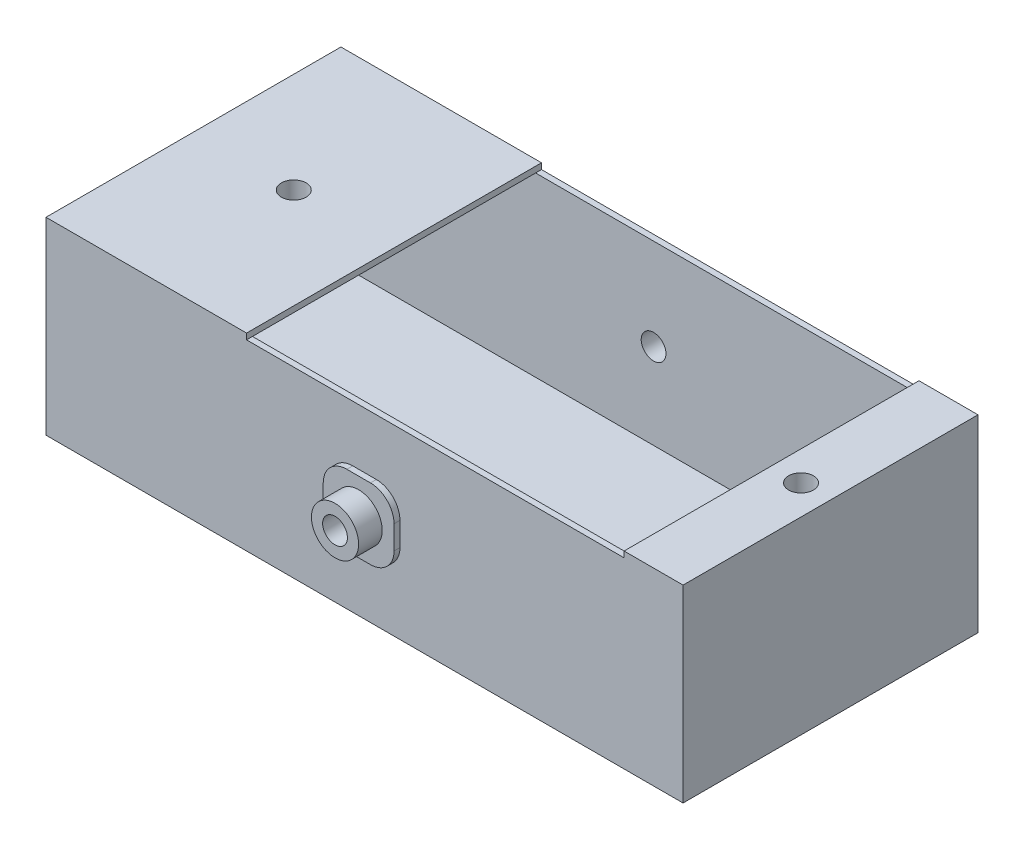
from build123d import *

# Parameters (mm, degrees)
SKETCH1_W           = 540
SKETCH1_H           = 250
BOSS_EXTRUDE1_DEPTH = 5
SKETCH2_W           = 540
SKETCH2_H           = 250
SKETCH2_W_2         = 530
SKETCH2_H_2         = 240
BOSS_EXTRUDE2_DEPTH = 150
SKETCH3_W           = 170
SKETCH3_H           = 250
SKETCH3_R           = 10.5
SKETCH3_W_2         = 50
BOSS_EXTRUDE3_DEPTH = 5
SKETCH4_R           = 20
SKETCH4_R_2         = 10.5
BOSS_EXTRUDE4_DEPTH = 25
SKETCH5_W           = 60
SKETCH5_H           = 60
BOSS_EXTRUDE5_DEPTH = 5
FILLET1_R           = 20
FILLET2_R           = 20
SKETCH6_R           = 10.5
CUT_EXTRUDE1_DEPTH  = 421.594816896
BOSS_EXTRUDE6_START = -30
SKETCH7_R           = 20
SKETCH7_R_2         = 10.5
BOSS_EXTRUDE6_DEPTH = 30
BOSS_EXTRUDE8_START = -10
SKETCH8_W           = 60
SKETCH8_H           = 60
SKETCH8_R           = 10.5
BOSS_EXTRUDE8_DEPTH = 10
BOSS_EXTRUDE9_START = -25
SKETCH9_W           = 30
SKETCH9_H           = 50
SKETCH9_R           = 10.5
BOSS_EXTRUDE9_DEPTH = 25
FILLET3_R           = 5


with BuildPart() as part:
    # Sketch1 → Boss-Extrude1 (new body)
    with BuildSketch(Plane(origin=(0, 0, 0), x_dir=(1, 0, 0), z_dir=(0, 1, 0))):
        Rectangle(SKETCH1_W, SKETCH1_H)
    extrude(amount=BOSS_EXTRUDE1_DEPTH)

    # Sketch2 → Boss-Extrude2 (add)
    with BuildSketch(Plane(origin=(0, 5, 0), x_dir=(1, 0, 0), z_dir=(0, 1, 0))):
        Rectangle(SKETCH2_W, SKETCH2_H)
        Rectangle(SKETCH2_W_2, SKETCH2_H_2, mode=Mode.SUBTRACT)
    extrude(amount=BOSS_EXTRUDE2_DEPTH)

    # Sketch3 → Boss-Extrude3 (add)
    # profile 1 of 2: a face of its own
    with BuildSketch(Plane(origin=(0, 155, 0), x_dir=(1, 0, 0), z_dir=(0, 1, 0))):
        with Locations((-185, 0)):
            Rectangle(SKETCH3_W, SKETCH3_H)
        with Locations(Location((-185, 0, 0), (0, 0, 270))):
            Circle(SKETCH3_R, mode=Mode.SUBTRACT)
    # profile 2 of 2: a face of its own
    with BuildSketch(Plane(origin=(0, 155, 0), x_dir=(1, 0, 0), z_dir=(0, 1, 0))):
        with Locations((245, 0)):
            Rectangle(SKETCH3_W_2, SKETCH3_H)
        with Locations(Location((245, 0, 0), (0, 0, 270))):
            Circle(SKETCH3_R, mode=Mode.SUBTRACT)
    extrude(amount=BOSS_EXTRUDE3_DEPTH)

    # Sketch4 → Boss-Extrude4 (add)
    with BuildSketch(Plane.XY.offset(125)):
        with Locations(Location((0, 77.5, 0), (0, 0, 180))):
            Circle(SKETCH4_R)
        with Locations((0, 77.5)):
            Circle(SKETCH4_R_2, mode=Mode.SUBTRACT)
    boss_extrude4 = extrude(amount=BOSS_EXTRUDE4_DEPTH)

    # Sketch5 → Boss-Extrude5 (add)
    with BuildSketch(Plane.XY.offset(125)):
        with Locations((0, 77.5)):
            Rectangle(SKETCH5_W, SKETCH5_H)
    boss_extrude5 = extrude(amount=BOSS_EXTRUDE5_DEPTH)

    # Fillet1
    fillet1_edges = [part.edges().sort_by_distance(p)[0] for p in [
        (-30, 107.5, 127.5),
        (-30, 47.5, 127.5),
        (30, 47.5, 127.5),
        (30, 107.5, 127.5),
    ]]
    fillet(fillet1_edges, radius=FILLET1_R)

    # Mirror1: Boss-Extrude4, Boss-Extrude5 across plane
    add(boss_extrude4.mirror(Plane.XY))
    add(boss_extrude5.mirror(Plane.XY))

    # Fillet2
    fillet2_edges = [part.edges().sort_by_distance(p)[0] for p in [
        (-30, 47.5, -127.5),
        (-30, 107.5, -127.5),
        (30, 107.5, -127.5),
        (30, 47.5, -127.5),
    ]]
    fillet(fillet2_edges, radius=FILLET2_R)

    # Sketch6 → Cut-Extrude1 (cut, through all)
    with BuildSketch(Plane(origin=(0, 0, -130), x_dir=(-1, 0, 0), z_dir=(0, 0, -1))):
        with Locations((0, 77.5)):
            Circle(SKETCH6_R)
    extrude(amount=-CUT_EXTRUDE1_DEPTH, mode=Mode.SUBTRACT)

    # Sketch7 → Boss-Extrude6 (add)
    with BuildSketch(Plane(origin=(0, 160, 0), x_dir=(1, 0, 0), z_dir=(0, 1, 0)).offset(BOSS_EXTRUDE6_START)):
        with Locations(Location((-185, 0, 0), (0, 0, 270))):
            Circle(SKETCH7_R)
        with Locations(Location((-185, 0, 0), (0, 0, 270))):
            Circle(SKETCH7_R_2, mode=Mode.SUBTRACT)
    extrude(amount=BOSS_EXTRUDE6_DEPTH)

    # Sketch8 → Boss-Extrude8 (add)
    with BuildSketch(Plane(origin=(0, 160, 0), x_dir=(1, 0, 0), z_dir=(0, 1, 0)).offset(BOSS_EXTRUDE8_START)):
        with Locations((-185, 0)):
            Rectangle(SKETCH8_W, SKETCH8_H)
        with Locations(Location((-185, 0, 0), (0, 0, 270))):
            Circle(SKETCH8_R, mode=Mode.SUBTRACT)
    extrude(amount=BOSS_EXTRUDE8_DEPTH)

    # Sketch9 → Boss-Extrude9 (add)
    with BuildSketch(Plane(origin=(0, 160, 0), x_dir=(1, 0, 0), z_dir=(0, 1, 0)).offset(BOSS_EXTRUDE9_START)):
        with Locations((245, 0)):
            Rectangle(SKETCH9_W, SKETCH9_H)
        with Locations(Location((245, 0, 0), (0, 0, 270))):
            Circle(SKETCH9_R, mode=Mode.SUBTRACT)
    extrude(amount=BOSS_EXTRUDE9_DEPTH)

    # Fillet3
    fillet3_edges = [part.edges().sort_by_distance(p)[0] for p in [
        (-155, 152.5, -30),
        (-155, 152.5, 30),
        (230, 145, 25),
        (230, 145, -25),
        (260, 145, -25),
        (260, 145, 25),
    ]]
    fillet(fillet3_edges, radius=FILLET3_R)


solid = part.part
